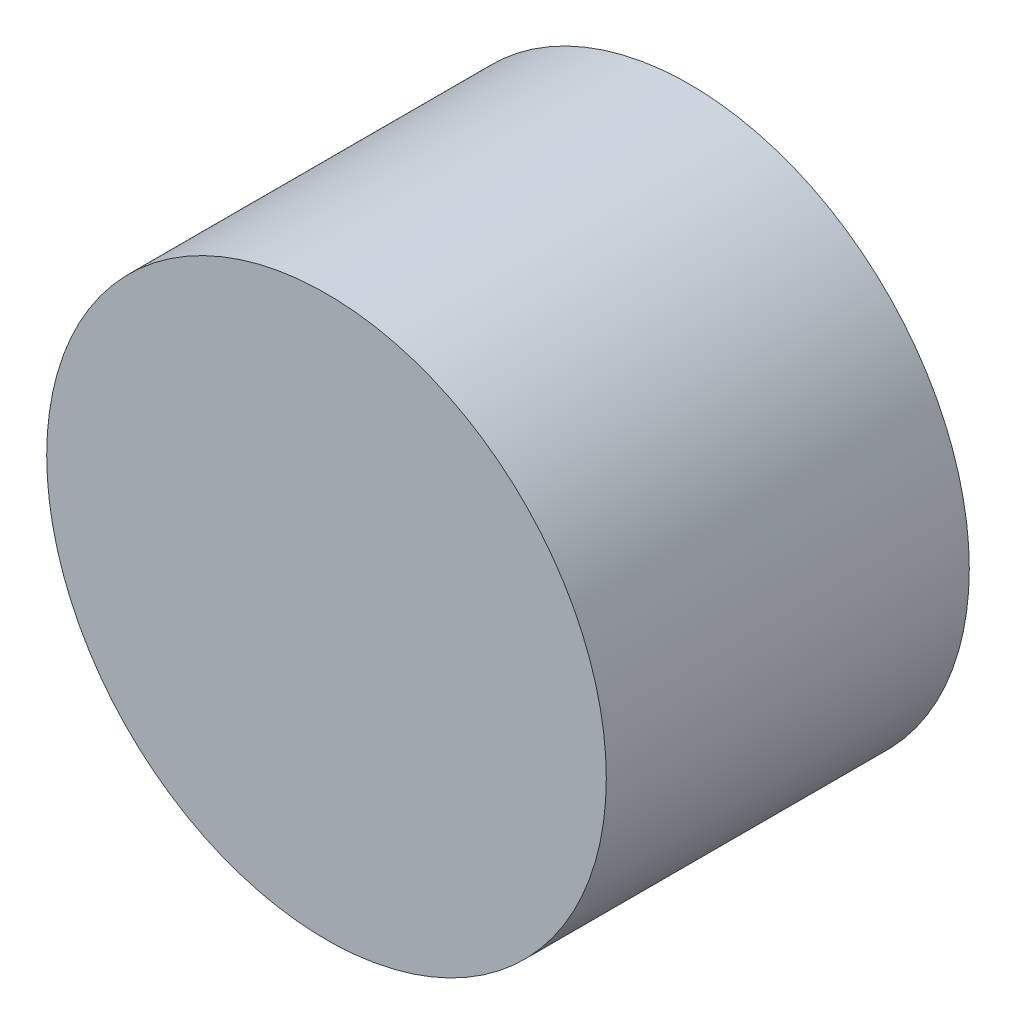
ISO-10303-21;
HEADER;
FILE_DESCRIPTION(('STEP AP214'),'2;1');
FILE_NAME('part.step','',(''),(''),'','','');
FILE_SCHEMA(('AUTOMOTIVE_DESIGN { 1 0 10303 214 1 1 1 1 }'));
ENDSEC;
DATA;
#1=APPLICATION_CONTEXT('core data for automotive mechanical design processes');
#2=APPLICATION_PROTOCOL_DEFINITION('international standard','automotive_design',2000,#1);
#3=PRODUCT_CONTEXT('',#1,'mechanical');
#4=PRODUCT('Part','Part','',(#3));
#5=PRODUCT_RELATED_PRODUCT_CATEGORY('part','',(#4));
#6=PRODUCT_DEFINITION_FORMATION('','',#4);
#7=PRODUCT_DEFINITION_CONTEXT('part definition',#1,'design');
#8=PRODUCT_DEFINITION('design','',#6,#7);
#9=PRODUCT_DEFINITION_SHAPE('','',#8);
#10=(LENGTH_UNIT() NAMED_UNIT(*) SI_UNIT(.MILLI.,.METRE.));
#11=(NAMED_UNIT(*) PLANE_ANGLE_UNIT() SI_UNIT($,.RADIAN.));
#12=(NAMED_UNIT(*) SI_UNIT($,.STERADIAN.) SOLID_ANGLE_UNIT());
#13=UNCERTAINTY_MEASURE_WITH_UNIT(LENGTH_MEASURE(1.E-05),#10,'distance_accuracy_value','');
#14=(GEOMETRIC_REPRESENTATION_CONTEXT(3) GLOBAL_UNCERTAINTY_ASSIGNED_CONTEXT((#13)) GLOBAL_UNIT_ASSIGNED_CONTEXT((#10,
#11,#12)) REPRESENTATION_CONTEXT('',''));
#15=CARTESIAN_POINT('',(0.,0.,0.));
#16=DIRECTION('',(0.,0.,1.));
#17=DIRECTION('',(1.,0.,0.));
#18=AXIS2_PLACEMENT_3D('',#15,#16,#17);
#19=CARTESIAN_POINT('',(0.,0.,12.));
#20=DIRECTION('',(0.,0.,1.));
#21=DIRECTION('',(1.,0.,0.));
#22=AXIS2_PLACEMENT_3D('',#19,#20,#21);
#23=PLANE('',#22);
#24=CARTESIAN_POINT('',(0.,0.,12.));
#25=DIRECTION('',(0.,0.,-1.));
#26=DIRECTION('',(-1.,0.,0.));
#27=AXIS2_PLACEMENT_3D('',#24,#25,#26);
#28=CIRCLE('',#27,18.5);
#29=CARTESIAN_POINT('',(-18.5,0.,12.));
#30=VERTEX_POINT('',#29);
#31=EDGE_CURVE('E10',#30,#30,#28,.T.);
#32=ORIENTED_EDGE('',*,*,#31,.F.);
#33=EDGE_LOOP('',(#32));
#34=FACE_BOUND('',#33,.T.);
#35=ADVANCED_FACE('F15',(#34),#23,.T.);
#36=CARTESIAN_POINT('',(0.,0.,-12.));
#37=DIRECTION('',(0.,0.,-1.));
#38=DIRECTION('',(-1.,0.,0.));
#39=AXIS2_PLACEMENT_3D('',#36,#37,#38);
#40=PLANE('',#39);
#41=CARTESIAN_POINT('',(0.,0.,-12.));
#42=DIRECTION('',(0.,0.,1.));
#43=DIRECTION('',(1.,0.,0.));
#44=AXIS2_PLACEMENT_3D('',#41,#42,#43);
#45=CIRCLE('',#44,18.5);
#46=CARTESIAN_POINT('',(18.5,0.,-12.));
#47=VERTEX_POINT('',#46);
#48=EDGE_CURVE('E22',#47,#47,#45,.T.);
#49=ORIENTED_EDGE('',*,*,#48,.F.);
#50=EDGE_LOOP('',(#49));
#51=FACE_BOUND('',#50,.T.);
#52=ADVANCED_FACE('F26',(#51),#40,.T.);
#53=CARTESIAN_POINT('',(0.,0.,-12.));
#54=DIRECTION('',(0.,0.,1.));
#55=DIRECTION('',(1.,0.,0.));
#56=AXIS2_PLACEMENT_3D('',#53,#54,#55);
#57=CYLINDRICAL_SURFACE('',#56,18.5);
#58=ORIENTED_EDGE('',*,*,#31,.T.);
#59=EDGE_LOOP('',(#58));
#60=FACE_BOUND('',#59,.T.);
#61=ORIENTED_EDGE('',*,*,#48,.T.);
#62=EDGE_LOOP('',(#61));
#63=FACE_BOUND('',#62,.T.);
#64=ADVANCED_FACE('F17',(#60,#63),#57,.T.);
#65=CLOSED_SHELL('',(#35,#52,#64));
#66=MANIFOLD_SOLID_BREP('B1',#65);
#67=ADVANCED_BREP_SHAPE_REPRESENTATION('',(#18,#66),#14);
#68=SHAPE_DEFINITION_REPRESENTATION(#9,#67);
ENDSEC;
END-ISO-10303-21;
